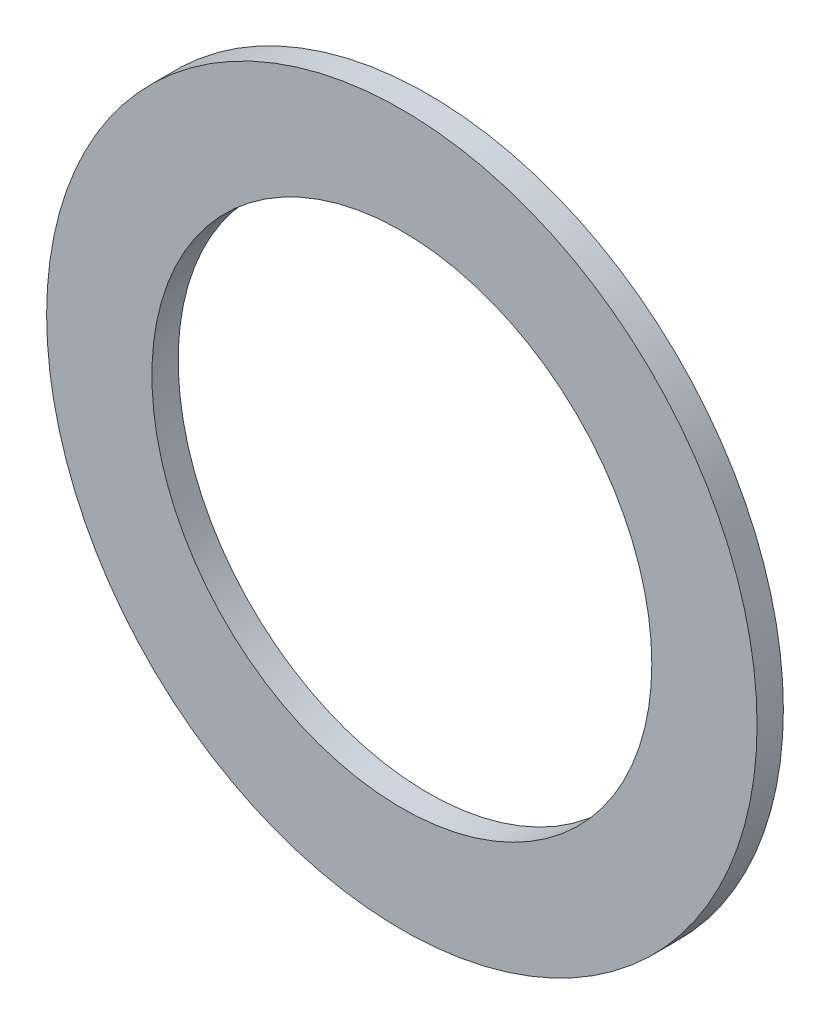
from build123d import *

# Parameters (mm, degrees)
ESQUISSE1_R          = 6.75
ESQUISSE1_R_2        = 4.75
BASE_EXTRUSION_DEPTH = 0.25


with BuildPart() as part:
    # Esquisse1 → Base-Extrusion (new, symmetric)
    with BuildSketch(Plane.XY):
        Circle(ESQUISSE1_R)
        Circle(ESQUISSE1_R_2, mode=Mode.SUBTRACT)
    extrude(amount=BASE_EXTRUSION_DEPTH, both=True)


solid = part.part
